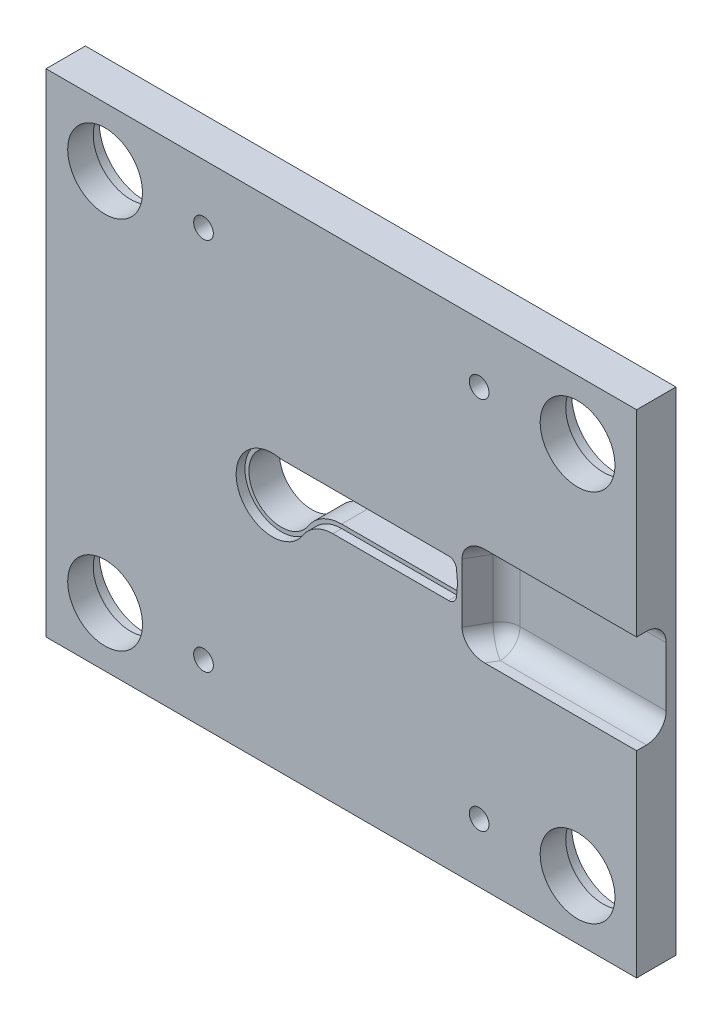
from build123d import *

# Parameters (mm, degrees)
ESQUISSE1_W              = 300
ESQUISSE1_H              = 250
BASE_EXTRUSION_DEPTH     = 20
ENL_V_MAT_EXTRU_1_DEPTH  = 392.02429592
ENL_V_MAT_EXTRU_9_DEPTH  = 4.5
ESQUISSE17_W             = 80
ESQUISSE17_H             = 50
ENL_V_MAT_EXTRU_11_DEPTH = 15
D_POUILLE1_ANGLE         = 30
CONG_1_R                 = 10
ESQUISSE18_R             = 23
ENL_V_MAT_EXTRU_12_DEPTH = 7
ESQUISSE19_R             = 19
ENL_V_MAT_EXTRU_13_DEPTH = 391.728806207
TROU_TARAUD_M101_D       = 10


with BuildPart() as part:
    # Esquisse1 → Base-Extrusion (new body)
    with BuildSketch(Plane.XY):
        with Locations((150, 125)):
            Rectangle(ESQUISSE1_W, ESQUISSE1_H)
    extrude(amount=BASE_EXTRUSION_DEPTH)

    # Esquisse2 → Enl_v. mat.-Extru.1 (cut, through all)
    with BuildSketch(Plane.XY.offset(20)):
        with BuildLine():
            Line((121.07819052, 135.935), (204.489847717, 135.935))
            ThreePointArc((204.489847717, 135.935), (205.861295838, 135.401672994), (206.512122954, 134.081926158))
            Line((206.512122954, 134.081926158), (207.033723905, 128.12))
            Line((207.033723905, 128.12), (206.512122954, 122.158073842))
            ThreePointArc((206.512122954, 122.158073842), (205.861295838, 120.838327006), (204.489847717, 120.305))
            Line((204.489847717, 120.305), (145.681427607, 120.305))
            ThreePointArc((145.681427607, 120.305), (136.083538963, 117.855711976), (128.832928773, 111.106850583))
            ThreePointArc((128.832928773, 111.106850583), (99.957582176, 113.354423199), (117.740393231, 136.215063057))
            ThreePointArc((117.740393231, 136.215063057), (119.403427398, 136.005138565), (121.07819052, 135.935))
        make_face()
    extrude(amount=-ENL_V_MAT_EXTRU_1_DEPTH, mode=Mode.SUBTRACT)

    # Esquisse10 → Enl_v. mat.-Extru.9 (cut)
    with BuildSketch(Plane.XY.offset(20)):
        with BuildLine():
            Line((208.50451235, 121.983762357), (209.041363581, 128.12))
            Line((209.041363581, 128.12), (208.50451235, 134.256237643))
            ThreePointArc((208.50451235, 134.256237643), (207.212476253, 136.876227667), (204.489847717, 137.935))
            Line((204.489847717, 137.935), (121.07819052, 137.935))
            ThreePointArc((121.07819052, 137.935), (119.570652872, 137.998135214), (118.07367304, 138.187098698))
            ThreePointArc((118.07367304, 138.187098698), (98.128160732, 112.546204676), (130.515255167, 110.025287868))
            ThreePointArc((130.515255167, 110.025287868), (137.041890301, 116.100273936), (145.681427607, 118.305))
            Line((145.681427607, 118.305), (204.489847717, 118.305))
            ThreePointArc((204.489847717, 118.305), (207.212476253, 119.363772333), (208.50451235, 121.983762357))
        make_face()
    extrude(amount=-ENL_V_MAT_EXTRU_9_DEPTH, mode=Mode.SUBTRACT)

    # Esquisse17 → Enl_v. mat.-Extru.11 (cut)
    with BuildSketch(Plane.XY.offset(20)):
        with Locations((260, 125)):
            Rectangle(ESQUISSE17_W, ESQUISSE17_H)
    extrude(amount=-ENL_V_MAT_EXTRU_11_DEPTH, mode=Mode.SUBTRACT)

    # D_pouille1
    d_pouille1_faces = [part.faces().sort_by_distance(p)[0] for p in [
        (220, 125, 12.5),
    ]]
    draft(d_pouille1_faces, Plane(origin=(300, 100, 5), x_dir=(1, 0, 0), z_dir=(0, 0, 1)), D_POUILLE1_ANGLE)

    # Cong_1
    cong_1_edges = [part.edges().sort_by_distance(p)[0] for p in [
        (260, 100, 5),
        (220, 125, 5),
        (215.669872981, 100, 12.5),
        (260, 150, 5),
        (215.669872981, 150, 12.5),
    ]]
    fillet(cong_1_edges, radius=CONG_1_R)

    # Esquisse18 → Enl_v. mat.-Extru.12 (cut)
    with BuildSketch(Plane(origin=(0, 0, 0), x_dir=(-1, 0, 0), z_dir=(0, 0, -1))):
        with Locations((-30, 220)):
            Circle(ESQUISSE18_R)
        with Locations((-30, 30)):
            Circle(ESQUISSE18_R)
        with Locations((-270, 30)):
            Circle(ESQUISSE18_R)
        with Locations((-270, 220)):
            Circle(ESQUISSE18_R)
    extrude(amount=-ENL_V_MAT_EXTRU_12_DEPTH, mode=Mode.SUBTRACT)

    # Esquisse19 → Enl_v. mat.-Extru.13 (cut, through all)
    with BuildSketch(Plane(origin=(0, 0, 7), x_dir=(-1, 0, 0), z_dir=(0, 0, -1))):
        with Locations((-30, 220)):
            Circle(ESQUISSE19_R)
        with Locations((-30, 30)):
            Circle(ESQUISSE19_R)
        with Locations((-270, 30)):
            Circle(ESQUISSE19_R)
        with Locations((-270, 220)):
            Circle(ESQUISSE19_R)
    extrude(amount=-ENL_V_MAT_EXTRU_13_DEPTH, mode=Mode.SUBTRACT)

    # Trou taraud_ M101 (through all)
    with Locations(Plane(origin=(0, 0, 0), x_dir=(-1, 0, 0), z_dir=(0, 0, -1))):
        with Locations((-220, 220), (-80, 220), (-80, 30), (-220, 30)):
            Hole(TROU_TARAUD_M101_D / 2)


solid = part.part
